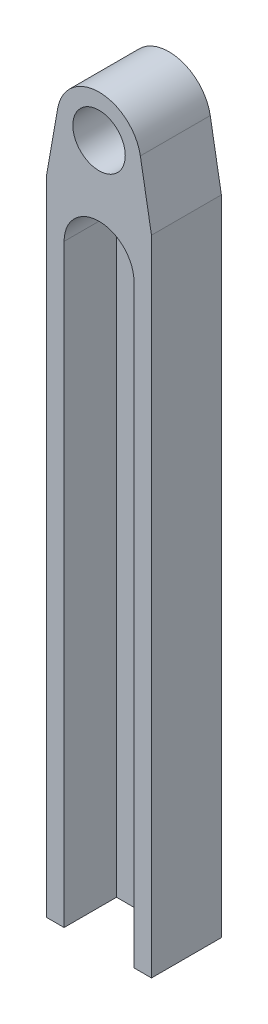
ISO-10303-21;
HEADER;
FILE_DESCRIPTION(('STEP AP214'),'2;1');
FILE_NAME('part.step','',(''),(''),'','','');
FILE_SCHEMA(('AUTOMOTIVE_DESIGN { 1 0 10303 214 1 1 1 1 }'));
ENDSEC;
DATA;
#1=APPLICATION_CONTEXT('core data for automotive mechanical design processes');
#2=APPLICATION_PROTOCOL_DEFINITION('international standard','automotive_design',2000,#1);
#3=PRODUCT_CONTEXT('',#1,'mechanical');
#4=PRODUCT('Part','Part','',(#3));
#5=PRODUCT_RELATED_PRODUCT_CATEGORY('part','',(#4));
#6=PRODUCT_DEFINITION_FORMATION('','',#4);
#7=PRODUCT_DEFINITION_CONTEXT('part definition',#1,'design');
#8=PRODUCT_DEFINITION('design','',#6,#7);
#9=PRODUCT_DEFINITION_SHAPE('','',#8);
#10=(LENGTH_UNIT() NAMED_UNIT(*) SI_UNIT(.MILLI.,.METRE.));
#11=(NAMED_UNIT(*) PLANE_ANGLE_UNIT() SI_UNIT($,.RADIAN.));
#12=(NAMED_UNIT(*) SI_UNIT($,.STERADIAN.) SOLID_ANGLE_UNIT());
#13=UNCERTAINTY_MEASURE_WITH_UNIT(LENGTH_MEASURE(1.E-05),#10,'distance_accuracy_value','');
#14=(GEOMETRIC_REPRESENTATION_CONTEXT(3) GLOBAL_UNCERTAINTY_ASSIGNED_CONTEXT((#13)) GLOBAL_UNIT_ASSIGNED_CONTEXT((#10,
#11,#12)) REPRESENTATION_CONTEXT('',''));
#15=CARTESIAN_POINT('',(0.,0.,0.));
#16=DIRECTION('',(0.,0.,1.));
#17=DIRECTION('',(1.,0.,0.));
#18=AXIS2_PLACEMENT_3D('',#15,#16,#17);
#19=CARTESIAN_POINT('',(0.,0.,0.));
#20=DIRECTION('',(0.,0.,1.));
#21=DIRECTION('',(1.,0.,0.));
#22=AXIS2_PLACEMENT_3D('',#19,#20,#21);
#23=PLANE('',#22);
#24=CARTESIAN_POINT('',(0.,-9.52500000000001,0.));
#25=DIRECTION('',(0.,0.,1.));
#26=DIRECTION('',(1.,0.,0.));
#27=AXIS2_PLACEMENT_3D('',#24,#25,#26);
#28=CIRCLE('',#27,3.175);
#29=CARTESIAN_POINT('',(3.175,-9.52500000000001,0.));
#30=VERTEX_POINT('',#29);
#31=CARTESIAN_POINT('',(-3.175,-9.52500000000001,0.));
#32=VERTEX_POINT('',#31);
#33=EDGE_CURVE('E59',#30,#32,#28,.T.);
#34=ORIENTED_EDGE('',*,*,#33,.T.);
#35=DIRECTION('',(0.,-1.,0.));
#36=VECTOR('',#35,1.);
#37=CARTESIAN_POINT('',(-3.175,0.,0.));
#38=LINE('',#37,#36);
#39=CARTESIAN_POINT('',(-3.175,-63.5,0.));
#40=VERTEX_POINT('',#39);
#41=EDGE_CURVE('E142',#32,#40,#38,.T.);
#42=ORIENTED_EDGE('',*,*,#41,.T.);
#43=DIRECTION('',(1.,0.,0.));
#44=VECTOR('',#43,1.);
#45=CARTESIAN_POINT('',(0.,-63.5,0.));
#46=LINE('',#45,#44);
#47=CARTESIAN_POINT('',(3.175,-63.5,0.));
#48=VERTEX_POINT('',#47);
#49=EDGE_CURVE('E130',#40,#48,#46,.T.);
#50=ORIENTED_EDGE('',*,*,#49,.T.);
#51=DIRECTION('',(0.,-1.,0.));
#52=VECTOR('',#51,1.);
#53=CARTESIAN_POINT('',(3.175,0.,0.));
#54=LINE('',#53,#52);
#55=EDGE_CURVE('E64',#30,#48,#54,.T.);
#56=ORIENTED_EDGE('',*,*,#55,.F.);
#57=EDGE_LOOP('',(#34,#42,#50,#56));
#58=FACE_BOUND('',#57,.T.);
#59=ADVANCED_FACE('F42',(#58),#23,.T.);
#60=CARTESIAN_POINT('',(-4.7625,0.,-1.5875));
#61=DIRECTION('',(-1.,0.,0.));
#62=DIRECTION('',(0.,-1.,0.));
#63=AXIS2_PLACEMENT_3D('',#60,#61,#62);
#64=PLANE('',#63);
#65=DIRECTION('',(0.,0.,1.));
#66=VECTOR('',#65,1.);
#67=CARTESIAN_POINT('',(-4.76249999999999,-63.5,-1.5875));
#68=LINE('',#67,#66);
#69=CARTESIAN_POINT('',(-4.76249999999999,-63.5,-1.5875));
#70=VERTEX_POINT('',#69);
#71=CARTESIAN_POINT('',(-4.76249999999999,-63.5,4.7625));
#72=VERTEX_POINT('',#71);
#73=EDGE_CURVE('E171',#70,#72,#68,.T.);
#74=ORIENTED_EDGE('',*,*,#73,.T.);
#75=DIRECTION('',(0.,-1.,0.));
#76=VECTOR('',#75,1.);
#77=CARTESIAN_POINT('',(-4.7625,0.,4.7625));
#78=LINE('',#77,#76);
#79=CARTESIAN_POINT('',(-4.7625,-5.0685641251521,4.7625));
#80=VERTEX_POINT('',#79);
#81=EDGE_CURVE('E205',#80,#72,#78,.T.);
#82=ORIENTED_EDGE('',*,*,#81,.F.);
#83=DIRECTION('',(0.,0.,1.));
#84=VECTOR('',#83,1.);
#85=CARTESIAN_POINT('',(-4.7625,-5.0685641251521,-1.5875));
#86=LINE('',#85,#84);
#87=CARTESIAN_POINT('',(-4.7625,-5.0685641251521,-1.5875));
#88=VERTEX_POINT('',#87);
#89=EDGE_CURVE('E12',#88,#80,#86,.T.);
#90=ORIENTED_EDGE('',*,*,#89,.F.);
#91=DIRECTION('',(0.,-1.,0.));
#92=VECTOR('',#91,1.);
#93=CARTESIAN_POINT('',(-4.7625,0.,-1.5875));
#94=LINE('',#93,#92);
#95=EDGE_CURVE('E152',#88,#70,#94,.T.);
#96=ORIENTED_EDGE('',*,*,#95,.T.);
#97=EDGE_LOOP('',(#74,#82,#90,#96));
#98=FACE_BOUND('',#97,.T.);
#99=ADVANCED_FACE('F44',(#98),#64,.T.);
#100=CARTESIAN_POINT('',(-3.75211753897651,0.661599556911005,-1.5875));
#101=DIRECTION('',(-0.984807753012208,0.173648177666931,0.));
#102=DIRECTION('',(-0.173648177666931,-0.984807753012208,0.));
#103=AXIS2_PLACEMENT_3D('',#100,#101,#102);
#104=PLANE('',#103);
#105=ORIENTED_EDGE('',*,*,#89,.T.);
#106=DIRECTION('',(-0.173648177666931,-0.984807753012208,0.));
#107=VECTOR('',#106,1.);
#108=CARTESIAN_POINT('',(-3.75211753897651,0.661599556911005,4.7625));
#109=LINE('',#108,#107);
#110=CARTESIAN_POINT('',(-3.75211753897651,0.661599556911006,4.7625));
#111=VERTEX_POINT('',#110);
#112=EDGE_CURVE('E202',#111,#80,#109,.T.);
#113=ORIENTED_EDGE('',*,*,#112,.F.);
#114=DIRECTION('',(0.,0.,1.));
#115=VECTOR('',#114,1.);
#116=CARTESIAN_POINT('',(-3.75211753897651,0.661599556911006,-1.5875));
#117=LINE('',#116,#115);
#118=CARTESIAN_POINT('',(-3.75211753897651,0.661599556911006,-1.5875));
#119=VERTEX_POINT('',#118);
#120=EDGE_CURVE('E51',#119,#111,#117,.T.);
#121=ORIENTED_EDGE('',*,*,#120,.F.);
#122=DIRECTION('',(-0.173648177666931,-0.984807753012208,0.));
#123=VECTOR('',#122,1.);
#124=CARTESIAN_POINT('',(-3.75211753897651,0.661599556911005,-1.5875));
#125=LINE('',#124,#123);
#126=EDGE_CURVE('E165',#119,#88,#125,.T.);
#127=ORIENTED_EDGE('',*,*,#126,.T.);
#128=EDGE_LOOP('',(#105,#113,#121,#127));
#129=FACE_BOUND('',#128,.T.);
#130=ADVANCED_FACE('F220',(#129),#104,.T.);
#131=CARTESIAN_POINT('',(0.,0.,-1.5875));
#132=DIRECTION('',(0.,0.,1.));
#133=DIRECTION('',(1.,0.,0.));
#134=AXIS2_PLACEMENT_3D('',#131,#132,#133);
#135=CYLINDRICAL_SURFACE('',#134,3.81);
#136=ORIENTED_EDGE('',*,*,#120,.T.);
#137=CARTESIAN_POINT('',(0.,0.,4.7625));
#138=DIRECTION('',(0.,0.,1.));
#139=DIRECTION('',(1.,0.,0.));
#140=AXIS2_PLACEMENT_3D('',#137,#138,#139);
#141=CIRCLE('',#140,3.81);
#142=CARTESIAN_POINT('',(3.75211753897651,0.661599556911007,4.7625));
#143=VERTEX_POINT('',#142);
#144=EDGE_CURVE('E199',#143,#111,#141,.T.);
#145=ORIENTED_EDGE('',*,*,#144,.F.);
#146=DIRECTION('',(0.,0.,1.));
#147=VECTOR('',#146,1.);
#148=CARTESIAN_POINT('',(3.75211753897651,0.661599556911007,-1.5875));
#149=LINE('',#148,#147);
#150=CARTESIAN_POINT('',(3.75211753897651,0.661599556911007,-1.5875));
#151=VERTEX_POINT('',#150);
#152=EDGE_CURVE('E373',#151,#143,#149,.T.);
#153=ORIENTED_EDGE('',*,*,#152,.F.);
#154=CARTESIAN_POINT('',(0.,0.,-1.5875));
#155=DIRECTION('',(0.,0.,1.));
#156=DIRECTION('',(1.,0.,0.));
#157=AXIS2_PLACEMENT_3D('',#154,#155,#156);
#158=CIRCLE('',#157,3.81);
#159=EDGE_CURVE('E162',#151,#119,#158,.T.);
#160=ORIENTED_EDGE('',*,*,#159,.T.);
#161=EDGE_LOOP('',(#136,#145,#153,#160));
#162=FACE_BOUND('',#161,.T.);
#163=ADVANCED_FACE('F231',(#162),#135,.T.);
#164=CARTESIAN_POINT('',(3.75211753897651,0.661599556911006,-1.5875));
#165=DIRECTION('',(-0.984807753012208,-0.173648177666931,0.));
#166=DIRECTION('',(0.173648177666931,-0.984807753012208,0.));
#167=AXIS2_PLACEMENT_3D('',#164,#165,#166);
#168=PLANE('',#167);
#169=ORIENTED_EDGE('',*,*,#152,.T.);
#170=DIRECTION('',(0.173648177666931,-0.984807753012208,0.));
#171=VECTOR('',#170,1.);
#172=CARTESIAN_POINT('',(3.75211753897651,0.661599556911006,4.7625));
#173=LINE('',#172,#171);
#174=CARTESIAN_POINT('',(4.7625,-5.0685641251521,4.7625));
#175=VERTEX_POINT('',#174);
#176=EDGE_CURVE('E196',#143,#175,#173,.T.);
#177=ORIENTED_EDGE('',*,*,#176,.T.);
#178=DIRECTION('',(0.,0.,1.));
#179=VECTOR('',#178,1.);
#180=CARTESIAN_POINT('',(4.7625,-5.0685641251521,-1.5875));
#181=LINE('',#180,#179);
#182=CARTESIAN_POINT('',(4.7625,-5.0685641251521,-1.5875));
#183=VERTEX_POINT('',#182);
#184=EDGE_CURVE('E371',#183,#175,#181,.T.);
#185=ORIENTED_EDGE('',*,*,#184,.F.);
#186=DIRECTION('',(0.173648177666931,-0.984807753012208,0.));
#187=VECTOR('',#186,1.);
#188=CARTESIAN_POINT('',(3.75211753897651,0.661599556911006,-1.5875));
#189=LINE('',#188,#187);
#190=EDGE_CURVE('E160',#151,#183,#189,.T.);
#191=ORIENTED_EDGE('',*,*,#190,.F.);
#192=EDGE_LOOP('',(#169,#177,#185,#191));
#193=FACE_BOUND('',#192,.T.);
#194=ADVANCED_FACE('F235',(#193),#168,.F.);
#195=CARTESIAN_POINT('',(4.7625,0.,-1.5875));
#196=DIRECTION('',(-1.,0.,0.));
#197=DIRECTION('',(0.,-1.,0.));
#198=AXIS2_PLACEMENT_3D('',#195,#196,#197);
#199=PLANE('',#198);
#200=ORIENTED_EDGE('',*,*,#184,.T.);
#201=DIRECTION('',(0.,-1.,0.));
#202=VECTOR('',#201,1.);
#203=CARTESIAN_POINT('',(4.7625,0.,4.7625));
#204=LINE('',#203,#202);
#205=CARTESIAN_POINT('',(4.76250000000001,-63.5,4.7625));
#206=VERTEX_POINT('',#205);
#207=EDGE_CURVE('E193',#175,#206,#204,.T.);
#208=ORIENTED_EDGE('',*,*,#207,.T.);
#209=DIRECTION('',(0.,0.,1.));
#210=VECTOR('',#209,1.);
#211=CARTESIAN_POINT('',(4.76250000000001,-63.5,-1.5875));
#212=LINE('',#211,#210);
#213=CARTESIAN_POINT('',(4.76250000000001,-63.5,-1.5875));
#214=VERTEX_POINT('',#213);
#215=EDGE_CURVE('E369',#214,#206,#212,.T.);
#216=ORIENTED_EDGE('',*,*,#215,.F.);
#217=DIRECTION('',(0.,-1.,0.));
#218=VECTOR('',#217,1.);
#219=CARTESIAN_POINT('',(4.7625,0.,-1.5875));
#220=LINE('',#219,#218);
#221=EDGE_CURVE('E158',#183,#214,#220,.T.);
#222=ORIENTED_EDGE('',*,*,#221,.F.);
#223=EDGE_LOOP('',(#200,#208,#216,#222));
#224=FACE_BOUND('',#223,.T.);
#225=ADVANCED_FACE('F239',(#224),#199,.F.);
#226=CARTESIAN_POINT('',(0.,-63.5,-1.5875));
#227=DIRECTION('',(0.,-1.,0.));
#228=DIRECTION('',(0.,0.,-1.));
#229=AXIS2_PLACEMENT_3D('',#226,#227,#228);
#230=PLANE('',#229);
#231=ORIENTED_EDGE('',*,*,#49,.F.);
#232=DIRECTION('',(0.,0.,-1.));
#233=VECTOR('',#232,1.);
#234=CARTESIAN_POINT('',(-3.175,-63.5,79.0930981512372));
#235=LINE('',#234,#233);
#236=CARTESIAN_POINT('',(-3.175,-63.5,4.7625));
#237=VERTEX_POINT('',#236);
#238=EDGE_CURVE('E143',#237,#40,#235,.T.);
#239=ORIENTED_EDGE('',*,*,#238,.F.);
#240=DIRECTION('',(1.,0.,0.));
#241=VECTOR('',#240,1.);
#242=CARTESIAN_POINT('',(0.,-63.5,4.7625));
#243=LINE('',#242,#241);
#244=EDGE_CURVE('E125',#72,#237,#243,.T.);
#245=ORIENTED_EDGE('',*,*,#244,.F.);
#246=ORIENTED_EDGE('',*,*,#73,.F.);
#247=DIRECTION('',(1.,0.,0.));
#248=VECTOR('',#247,1.);
#249=CARTESIAN_POINT('',(0.,-63.5,-1.5875));
#250=LINE('',#249,#248);
#251=EDGE_CURVE('E155',#70,#214,#250,.T.);
#252=ORIENTED_EDGE('',*,*,#251,.T.);
#253=ORIENTED_EDGE('',*,*,#215,.T.);
#254=DIRECTION('',(1.,0.,0.));
#255=VECTOR('',#254,1.);
#256=CARTESIAN_POINT('',(0.,-63.5,4.7625));
#257=LINE('',#256,#255);
#258=CARTESIAN_POINT('',(3.175,-63.5,4.7625));
#259=VERTEX_POINT('',#258);
#260=EDGE_CURVE('E190',#259,#206,#257,.T.);
#261=ORIENTED_EDGE('',*,*,#260,.F.);
#262=DIRECTION('',(0.,0.,-1.));
#263=VECTOR('',#262,1.);
#264=CARTESIAN_POINT('',(3.175,-63.5,79.0930981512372));
#265=LINE('',#264,#263);
#266=EDGE_CURVE('E145',#259,#48,#265,.T.);
#267=ORIENTED_EDGE('',*,*,#266,.T.);
#268=EDGE_LOOP('',(#231,#239,#245,#246,#252,#253,#261,#267));
#269=FACE_BOUND('',#268,.T.);
#270=ADVANCED_FACE('F212',(#269),#230,.T.);
#271=CARTESIAN_POINT('',(0.,0.,-1.5875));
#272=DIRECTION('',(0.,0.,1.));
#273=DIRECTION('',(1.,0.,0.));
#274=AXIS2_PLACEMENT_3D('',#271,#272,#273);
#275=CYLINDRICAL_SURFACE('',#274,2.38125);
#276=CARTESIAN_POINT('',(0.,0.,-1.5875));
#277=DIRECTION('',(0.,0.,1.));
#278=DIRECTION('',(1.,0.,0.));
#279=AXIS2_PLACEMENT_3D('',#276,#277,#278);
#280=CIRCLE('',#279,2.38125);
#281=CARTESIAN_POINT('',(2.38125,0.,-1.5875));
#282=VERTEX_POINT('',#281);
#283=EDGE_CURVE('E168',#282,#282,#280,.T.);
#284=ORIENTED_EDGE('',*,*,#283,.F.);
#285=EDGE_LOOP('',(#284));
#286=FACE_BOUND('',#285,.T.);
#287=CARTESIAN_POINT('',(0.,0.,4.7625));
#288=DIRECTION('',(0.,0.,1.));
#289=DIRECTION('',(1.,0.,0.));
#290=AXIS2_PLACEMENT_3D('',#287,#288,#289);
#291=CIRCLE('',#290,2.38125);
#292=CARTESIAN_POINT('',(2.38125,0.,4.7625));
#293=VERTEX_POINT('',#292);
#294=EDGE_CURVE('E138',#293,#293,#291,.T.);
#295=ORIENTED_EDGE('',*,*,#294,.T.);
#296=EDGE_LOOP('',(#295));
#297=FACE_BOUND('',#296,.T.);
#298=ADVANCED_FACE('F225',(#286,#297),#275,.F.);
#299=CARTESIAN_POINT('',(0.,0.,-1.5875));
#300=DIRECTION('',(0.,0.,1.));
#301=DIRECTION('',(1.,0.,0.));
#302=AXIS2_PLACEMENT_3D('',#299,#300,#301);
#303=PLANE('',#302);
#304=ORIENTED_EDGE('',*,*,#95,.F.);
#305=ORIENTED_EDGE('',*,*,#126,.F.);
#306=ORIENTED_EDGE('',*,*,#159,.F.);
#307=ORIENTED_EDGE('',*,*,#190,.T.);
#308=ORIENTED_EDGE('',*,*,#221,.T.);
#309=ORIENTED_EDGE('',*,*,#251,.F.);
#310=EDGE_LOOP('',(#304,#305,#306,#307,#308,#309));
#311=FACE_BOUND('',#310,.T.);
#312=ORIENTED_EDGE('',*,*,#283,.T.);
#313=EDGE_LOOP('',(#312));
#314=FACE_BOUND('',#313,.T.);
#315=ADVANCED_FACE('F223',(#311,#314),#303,.F.);
#316=CARTESIAN_POINT('',(-3.175,0.,79.0930981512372));
#317=DIRECTION('',(1.,0.,0.));
#318=DIRECTION('',(0.,1.,0.));
#319=AXIS2_PLACEMENT_3D('',#316,#317,#318);
#320=PLANE('',#319);
#321=DIRECTION('',(0.,0.,-1.));
#322=VECTOR('',#321,1.);
#323=CARTESIAN_POINT('',(-3.175,-9.52500000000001,79.0930981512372));
#324=LINE('',#323,#322);
#325=CARTESIAN_POINT('',(-3.175,-9.52500000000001,4.7625));
#326=VERTEX_POINT('',#325);
#327=EDGE_CURVE('E135',#326,#32,#324,.T.);
#328=ORIENTED_EDGE('',*,*,#327,.F.);
#329=DIRECTION('',(0.,-1.,0.));
#330=VECTOR('',#329,1.);
#331=CARTESIAN_POINT('',(-3.175,0.,4.7625));
#332=LINE('',#331,#330);
#333=EDGE_CURVE('E118',#326,#237,#332,.T.);
#334=ORIENTED_EDGE('',*,*,#333,.T.);
#335=ORIENTED_EDGE('',*,*,#238,.T.);
#336=ORIENTED_EDGE('',*,*,#41,.F.);
#337=EDGE_LOOP('',(#328,#334,#335,#336));
#338=FACE_BOUND('',#337,.T.);
#339=ADVANCED_FACE('F141',(#338),#320,.T.);
#340=CARTESIAN_POINT('',(3.175,0.,79.0930981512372));
#341=DIRECTION('',(1.,0.,0.));
#342=DIRECTION('',(0.,1.,0.));
#343=AXIS2_PLACEMENT_3D('',#340,#341,#342);
#344=PLANE('',#343);
#345=DIRECTION('',(0.,-1.,0.));
#346=VECTOR('',#345,1.);
#347=CARTESIAN_POINT('',(3.175,0.,4.7625));
#348=LINE('',#347,#346);
#349=CARTESIAN_POINT('',(3.175,-9.52500000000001,4.7625));
#350=VERTEX_POINT('',#349);
#351=EDGE_CURVE('E139',#350,#259,#348,.T.);
#352=ORIENTED_EDGE('',*,*,#351,.F.);
#353=DIRECTION('',(0.,0.,-1.));
#354=VECTOR('',#353,1.);
#355=CARTESIAN_POINT('',(3.175,-9.52500000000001,79.0930981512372));
#356=LINE('',#355,#354);
#357=EDGE_CURVE('E131',#350,#30,#356,.T.);
#358=ORIENTED_EDGE('',*,*,#357,.T.);
#359=ORIENTED_EDGE('',*,*,#55,.T.);
#360=ORIENTED_EDGE('',*,*,#266,.F.);
#361=EDGE_LOOP('',(#352,#358,#359,#360));
#362=FACE_BOUND('',#361,.T.);
#363=ADVANCED_FACE('F264',(#362),#344,.F.);
#364=CARTESIAN_POINT('',(0.,-9.52500000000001,79.0930981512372));
#365=DIRECTION('',(0.,0.,-1.));
#366=DIRECTION('',(-1.,0.,0.));
#367=AXIS2_PLACEMENT_3D('',#364,#365,#366);
#368=CYLINDRICAL_SURFACE('',#367,3.175);
#369=ORIENTED_EDGE('',*,*,#357,.F.);
#370=CARTESIAN_POINT('',(0.,-9.52500000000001,4.7625));
#371=DIRECTION('',(0.,0.,1.));
#372=DIRECTION('',(1.,0.,0.));
#373=AXIS2_PLACEMENT_3D('',#370,#371,#372);
#374=CIRCLE('',#373,3.175);
#375=EDGE_CURVE('E121',#350,#326,#374,.T.);
#376=ORIENTED_EDGE('',*,*,#375,.T.);
#377=ORIENTED_EDGE('',*,*,#327,.T.);
#378=ORIENTED_EDGE('',*,*,#33,.F.);
#379=EDGE_LOOP('',(#369,#376,#377,#378));
#380=FACE_BOUND('',#379,.T.);
#381=ADVANCED_FACE('F134',(#380),#368,.F.);
#382=CARTESIAN_POINT('',(0.,0.,4.7625));
#383=DIRECTION('',(0.,0.,1.));
#384=DIRECTION('',(1.,0.,0.));
#385=AXIS2_PLACEMENT_3D('',#382,#383,#384);
#386=PLANE('',#385);
#387=ORIENTED_EDGE('',*,*,#294,.F.);
#388=EDGE_LOOP('',(#387));
#389=FACE_BOUND('',#388,.T.);
#390=ORIENTED_EDGE('',*,*,#375,.F.);
#391=ORIENTED_EDGE('',*,*,#351,.T.);
#392=ORIENTED_EDGE('',*,*,#260,.T.);
#393=ORIENTED_EDGE('',*,*,#207,.F.);
#394=ORIENTED_EDGE('',*,*,#176,.F.);
#395=ORIENTED_EDGE('',*,*,#144,.T.);
#396=ORIENTED_EDGE('',*,*,#112,.T.);
#397=ORIENTED_EDGE('',*,*,#81,.T.);
#398=ORIENTED_EDGE('',*,*,#244,.T.);
#399=ORIENTED_EDGE('',*,*,#333,.F.);
#400=EDGE_LOOP('',(#390,#391,#392,#393,#394,#395,#396,#397,#398,#399));
#401=FACE_BOUND('',#400,.T.);
#402=ADVANCED_FACE('F120',(#389,#401),#386,.T.);
#403=CLOSED_SHELL('',(#59,#99,#130,#163,#194,#225,#270,#298,#315,#339,#363,#381,#402));
#404=MANIFOLD_SOLID_BREP('B2',#403);
#405=ADVANCED_BREP_SHAPE_REPRESENTATION('',(#18,#404),#14);
#406=SHAPE_DEFINITION_REPRESENTATION(#9,#405);
ENDSEC;
END-ISO-10303-21;
